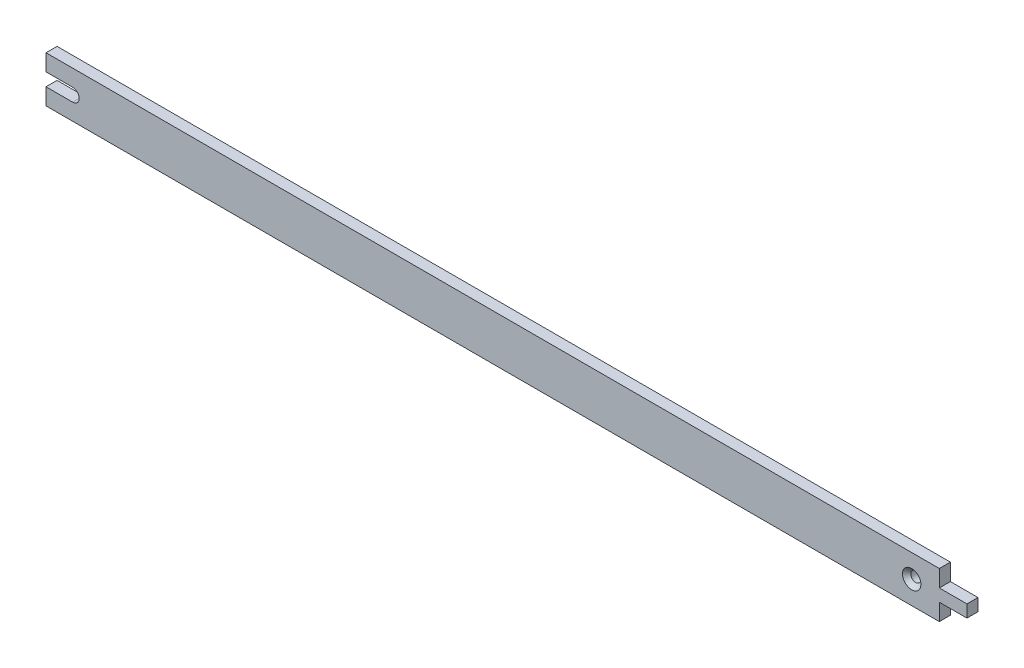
ISO-10303-21;
HEADER;
FILE_DESCRIPTION(('STEP AP214'),'2;1');
FILE_NAME('part.step','',(''),(''),'','','');
FILE_SCHEMA(('AUTOMOTIVE_DESIGN { 1 0 10303 214 1 1 1 1 }'));
ENDSEC;
DATA;
#1=APPLICATION_CONTEXT('core data for automotive mechanical design processes');
#2=APPLICATION_PROTOCOL_DEFINITION('international standard','automotive_design',2000,#1);
#3=PRODUCT_CONTEXT('',#1,'mechanical');
#4=PRODUCT('Part','Part','',(#3));
#5=PRODUCT_RELATED_PRODUCT_CATEGORY('part','',(#4));
#6=PRODUCT_DEFINITION_FORMATION('','',#4);
#7=PRODUCT_DEFINITION_CONTEXT('part definition',#1,'design');
#8=PRODUCT_DEFINITION('design','',#6,#7);
#9=PRODUCT_DEFINITION_SHAPE('','',#8);
#10=(LENGTH_UNIT() NAMED_UNIT(*) SI_UNIT(.MILLI.,.METRE.));
#11=(NAMED_UNIT(*) PLANE_ANGLE_UNIT() SI_UNIT($,.RADIAN.));
#12=(NAMED_UNIT(*) SI_UNIT($,.STERADIAN.) SOLID_ANGLE_UNIT());
#13=UNCERTAINTY_MEASURE_WITH_UNIT(LENGTH_MEASURE(1.E-05),#10,'distance_accuracy_value','');
#14=(GEOMETRIC_REPRESENTATION_CONTEXT(3) GLOBAL_UNCERTAINTY_ASSIGNED_CONTEXT((#13)) GLOBAL_UNIT_ASSIGNED_CONTEXT((#10,
#11,#12)) REPRESENTATION_CONTEXT('',''));
#15=CARTESIAN_POINT('',(0.,0.,0.));
#16=DIRECTION('',(0.,0.,1.));
#17=DIRECTION('',(1.,0.,0.));
#18=AXIS2_PLACEMENT_3D('',#15,#16,#17);
#19=CARTESIAN_POINT('',(15.,12.5,6.));
#20=DIRECTION('',(0.,0.,1.));
#21=DIRECTION('',(0.,1.,0.));
#22=AXIS2_PLACEMENT_3D('',#19,#20,#21);
#23=PLANE('',#22);
#24=DIRECTION('',(0.,1.,0.));
#25=VECTOR('',#24,1.);
#26=CARTESIAN_POINT('',(-470.,-23.4677185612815,6.));
#27=LINE('',#26,#25);
#28=CARTESIAN_POINT('',(-470.,-12.5,6.));
#29=VERTEX_POINT('',#28);
#30=CARTESIAN_POINT('',(-470.,-3.5,6.));
#31=VERTEX_POINT('',#30);
#32=EDGE_CURVE('E105',#29,#31,#27,.T.);
#33=ORIENTED_EDGE('',*,*,#32,.F.);
#34=DIRECTION('',(1.,0.,0.));
#35=VECTOR('',#34,1.);
#36=CARTESIAN_POINT('',(15.,-12.5,6.));
#37=LINE('',#36,#35);
#38=CARTESIAN_POINT('',(15.,-12.5,6.));
#39=VERTEX_POINT('',#38);
#40=EDGE_CURVE('E116',#29,#39,#37,.T.);
#41=ORIENTED_EDGE('',*,*,#40,.T.);
#42=DIRECTION('',(0.,1.,0.));
#43=VECTOR('',#42,1.);
#44=CARTESIAN_POINT('',(15.,-3.35,6.));
#45=LINE('',#44,#43);
#46=CARTESIAN_POINT('',(15.,-3.35,6.));
#47=VERTEX_POINT('',#46);
#48=EDGE_CURVE('E128',#39,#47,#45,.T.);
#49=ORIENTED_EDGE('',*,*,#48,.T.);
#50=DIRECTION('',(1.,0.,0.));
#51=VECTOR('',#50,1.);
#52=CARTESIAN_POINT('',(30.,-3.35,6.));
#53=LINE('',#52,#51);
#54=CARTESIAN_POINT('',(30.,-3.35,6.));
#55=VERTEX_POINT('',#54);
#56=EDGE_CURVE('E131',#47,#55,#53,.T.);
#57=ORIENTED_EDGE('',*,*,#56,.T.);
#58=DIRECTION('',(0.,1.,0.));
#59=VECTOR('',#58,1.);
#60=CARTESIAN_POINT('',(30.,-3.35,6.));
#61=LINE('',#60,#59);
#62=CARTESIAN_POINT('',(30.,3.35,6.));
#63=VERTEX_POINT('',#62);
#64=EDGE_CURVE('E34',#55,#63,#61,.T.);
#65=ORIENTED_EDGE('',*,*,#64,.T.);
#66=DIRECTION('',(-1.,0.,0.));
#67=VECTOR('',#66,1.);
#68=CARTESIAN_POINT('',(30.,3.35,6.));
#69=LINE('',#68,#67);
#70=CARTESIAN_POINT('',(15.,3.35,6.));
#71=VERTEX_POINT('',#70);
#72=EDGE_CURVE('E29',#63,#71,#69,.T.);
#73=ORIENTED_EDGE('',*,*,#72,.T.);
#74=DIRECTION('',(0.,1.,0.));
#75=VECTOR('',#74,1.);
#76=CARTESIAN_POINT('',(15.,3.35,6.));
#77=LINE('',#76,#75);
#78=CARTESIAN_POINT('',(15.,12.5,6.));
#79=VERTEX_POINT('',#78);
#80=EDGE_CURVE('E134',#71,#79,#77,.T.);
#81=ORIENTED_EDGE('',*,*,#80,.T.);
#82=DIRECTION('',(-1.,0.,0.));
#83=VECTOR('',#82,1.);
#84=CARTESIAN_POINT('',(15.,12.5,6.));
#85=LINE('',#84,#83);
#86=CARTESIAN_POINT('',(-470.,12.5,6.));
#87=VERTEX_POINT('',#86);
#88=EDGE_CURVE('E129',#79,#87,#85,.T.);
#89=ORIENTED_EDGE('',*,*,#88,.T.);
#90=CARTESIAN_POINT('',(-470.,3.5,6.));
#91=VERTEX_POINT('',#90);
#92=EDGE_CURVE('E122',#91,#87,#27,.T.);
#93=ORIENTED_EDGE('',*,*,#92,.F.);
#94=DIRECTION('',(-1.,0.,0.));
#95=VECTOR('',#94,1.);
#96=CARTESIAN_POINT('',(-455.5,3.5,6.));
#97=LINE('',#96,#95);
#98=CARTESIAN_POINT('',(-455.5,3.5,6.));
#99=VERTEX_POINT('',#98);
#100=EDGE_CURVE('E267',#99,#91,#97,.T.);
#101=ORIENTED_EDGE('',*,*,#100,.F.);
#102=CARTESIAN_POINT('',(-455.5,0.,6.));
#103=DIRECTION('',(0.,0.,1.));
#104=DIRECTION('',(-1.,0.,0.));
#105=AXIS2_PLACEMENT_3D('',#102,#103,#104);
#106=CIRCLE('',#105,3.5);
#107=CARTESIAN_POINT('',(-455.5,-3.5,6.));
#108=VERTEX_POINT('',#107);
#109=EDGE_CURVE('E264',#108,#99,#106,.T.);
#110=ORIENTED_EDGE('',*,*,#109,.F.);
#111=DIRECTION('',(1.,0.,0.));
#112=VECTOR('',#111,1.);
#113=CARTESIAN_POINT('',(-470.,-3.5,6.));
#114=LINE('',#113,#112);
#115=EDGE_CURVE('E120',#31,#108,#114,.T.);
#116=ORIENTED_EDGE('',*,*,#115,.F.);
#117=EDGE_LOOP('',(#33,#41,#49,#57,#65,#73,#81,#89,#93,#101,#110,#116));
#118=FACE_BOUND('',#117,.T.);
#119=CARTESIAN_POINT('',(0.,0.,6.));
#120=DIRECTION('',(0.,0.,1.));
#121=DIRECTION('',(0.,1.,0.));
#122=AXIS2_PLACEMENT_3D('',#119,#120,#121);
#123=CIRCLE('',#122,5.);
#124=CARTESIAN_POINT('',(0.,5.,6.));
#125=VERTEX_POINT('',#124);
#126=EDGE_CURVE('E9',#125,#125,#123,.F.);
#127=ORIENTED_EDGE('',*,*,#126,.T.);
#128=EDGE_LOOP('',(#127));
#129=FACE_BOUND('',#128,.T.);
#130=ADVANCED_FACE('F14',(#118,#129),#23,.T.);
#131=CARTESIAN_POINT('',(15.,12.5,0.));
#132=DIRECTION('',(0.,0.,1.));
#133=DIRECTION('',(0.,1.,0.));
#134=AXIS2_PLACEMENT_3D('',#131,#132,#133);
#135=PLANE('',#134);
#136=DIRECTION('',(1.,0.,0.));
#137=VECTOR('',#136,1.);
#138=CARTESIAN_POINT('',(15.,-12.5,0.));
#139=LINE('',#138,#137);
#140=CARTESIAN_POINT('',(-470.,-12.5,0.));
#141=VERTEX_POINT('',#140);
#142=CARTESIAN_POINT('',(15.,-12.5,0.));
#143=VERTEX_POINT('',#142);
#144=EDGE_CURVE('E220',#141,#143,#139,.T.);
#145=ORIENTED_EDGE('',*,*,#144,.F.);
#146=DIRECTION('',(0.,1.,0.));
#147=VECTOR('',#146,1.);
#148=CARTESIAN_POINT('',(-470.,-23.4677185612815,0.));
#149=LINE('',#148,#147);
#150=CARTESIAN_POINT('',(-470.,-3.5,0.));
#151=VERTEX_POINT('',#150);
#152=EDGE_CURVE('E108',#141,#151,#149,.T.);
#153=ORIENTED_EDGE('',*,*,#152,.T.);
#154=DIRECTION('',(1.,0.,0.));
#155=VECTOR('',#154,1.);
#156=CARTESIAN_POINT('',(-470.,-3.5,0.));
#157=LINE('',#156,#155);
#158=CARTESIAN_POINT('',(-455.5,-3.5,0.));
#159=VERTEX_POINT('',#158);
#160=EDGE_CURVE('E248',#151,#159,#157,.T.);
#161=ORIENTED_EDGE('',*,*,#160,.T.);
#162=CARTESIAN_POINT('',(-455.5,0.,0.));
#163=DIRECTION('',(0.,0.,1.));
#164=DIRECTION('',(-1.,0.,0.));
#165=AXIS2_PLACEMENT_3D('',#162,#163,#164);
#166=CIRCLE('',#165,3.5);
#167=CARTESIAN_POINT('',(-455.5,3.5,0.));
#168=VERTEX_POINT('',#167);
#169=EDGE_CURVE('E260',#159,#168,#166,.T.);
#170=ORIENTED_EDGE('',*,*,#169,.T.);
#171=DIRECTION('',(-1.,0.,0.));
#172=VECTOR('',#171,1.);
#173=CARTESIAN_POINT('',(-455.5,3.5,0.));
#174=LINE('',#173,#172);
#175=CARTESIAN_POINT('',(-470.,3.5,0.));
#176=VERTEX_POINT('',#175);
#177=EDGE_CURVE('E255',#168,#176,#174,.T.);
#178=ORIENTED_EDGE('',*,*,#177,.T.);
#179=CARTESIAN_POINT('',(-470.,12.5,0.));
#180=VERTEX_POINT('',#179);
#181=EDGE_CURVE('E121',#176,#180,#149,.T.);
#182=ORIENTED_EDGE('',*,*,#181,.T.);
#183=DIRECTION('',(-1.,0.,0.));
#184=VECTOR('',#183,1.);
#185=CARTESIAN_POINT('',(15.,12.5,0.));
#186=LINE('',#185,#184);
#187=CARTESIAN_POINT('',(15.,12.5,0.));
#188=VERTEX_POINT('',#187);
#189=EDGE_CURVE('E215',#188,#180,#186,.T.);
#190=ORIENTED_EDGE('',*,*,#189,.F.);
#191=DIRECTION('',(0.,1.,0.));
#192=VECTOR('',#191,1.);
#193=CARTESIAN_POINT('',(15.,3.35,0.));
#194=LINE('',#193,#192);
#195=CARTESIAN_POINT('',(15.,3.35,0.));
#196=VERTEX_POINT('',#195);
#197=EDGE_CURVE('E221',#196,#188,#194,.T.);
#198=ORIENTED_EDGE('',*,*,#197,.F.);
#199=DIRECTION('',(-1.,0.,0.));
#200=VECTOR('',#199,1.);
#201=CARTESIAN_POINT('',(30.,3.35,0.));
#202=LINE('',#201,#200);
#203=CARTESIAN_POINT('',(30.,3.35,0.));
#204=VERTEX_POINT('',#203);
#205=EDGE_CURVE('E234',#204,#196,#202,.T.);
#206=ORIENTED_EDGE('',*,*,#205,.F.);
#207=DIRECTION('',(0.,1.,0.));
#208=VECTOR('',#207,1.);
#209=CARTESIAN_POINT('',(30.,-3.35,0.));
#210=LINE('',#209,#208);
#211=CARTESIAN_POINT('',(30.,-3.35,0.));
#212=VERTEX_POINT('',#211);
#213=EDGE_CURVE('E232',#212,#204,#210,.T.);
#214=ORIENTED_EDGE('',*,*,#213,.F.);
#215=DIRECTION('',(1.,0.,0.));
#216=VECTOR('',#215,1.);
#217=CARTESIAN_POINT('',(30.,-3.35,0.));
#218=LINE('',#217,#216);
#219=CARTESIAN_POINT('',(15.,-3.35,0.));
#220=VERTEX_POINT('',#219);
#221=EDGE_CURVE('E230',#220,#212,#218,.T.);
#222=ORIENTED_EDGE('',*,*,#221,.F.);
#223=DIRECTION('',(0.,1.,0.));
#224=VECTOR('',#223,1.);
#225=CARTESIAN_POINT('',(15.,-3.35,0.));
#226=LINE('',#225,#224);
#227=EDGE_CURVE('E223',#143,#220,#226,.T.);
#228=ORIENTED_EDGE('',*,*,#227,.F.);
#229=EDGE_LOOP('',(#145,#153,#161,#170,#178,#182,#190,#198,#206,#214,#222,#228));
#230=FACE_BOUND('',#229,.T.);
#231=CARTESIAN_POINT('',(0.,0.,0.));
#232=DIRECTION('',(0.,0.,1.));
#233=DIRECTION('',(0.,1.,0.));
#234=AXIS2_PLACEMENT_3D('',#231,#232,#233);
#235=CIRCLE('',#234,2.75);
#236=CARTESIAN_POINT('',(0.,2.75,0.));
#237=VERTEX_POINT('',#236);
#238=EDGE_CURVE('E225',#237,#237,#235,.T.);
#239=ORIENTED_EDGE('',*,*,#238,.T.);
#240=EDGE_LOOP('',(#239));
#241=FACE_BOUND('',#240,.T.);
#242=ADVANCED_FACE('F180',(#230,#241),#135,.F.);
#243=CARTESIAN_POINT('',(15.,3.35,6.));
#244=DIRECTION('',(-1.,0.,0.));
#245=DIRECTION('',(0.,-1.,0.));
#246=AXIS2_PLACEMENT_3D('',#243,#244,#245);
#247=PLANE('',#246);
#248=ORIENTED_EDGE('',*,*,#197,.T.);
#249=DIRECTION('',(0.,0.,-1.));
#250=VECTOR('',#249,1.);
#251=CARTESIAN_POINT('',(15.,12.5,6.));
#252=LINE('',#251,#250);
#253=EDGE_CURVE('E154',#79,#188,#252,.T.);
#254=ORIENTED_EDGE('',*,*,#253,.F.);
#255=ORIENTED_EDGE('',*,*,#80,.F.);
#256=DIRECTION('',(0.,0.,-1.));
#257=VECTOR('',#256,1.);
#258=CARTESIAN_POINT('',(15.,3.35,6.));
#259=LINE('',#258,#257);
#260=EDGE_CURVE('E141',#71,#196,#259,.T.);
#261=ORIENTED_EDGE('',*,*,#260,.T.);
#262=EDGE_LOOP('',(#248,#254,#255,#261));
#263=FACE_BOUND('',#262,.T.);
#264=ADVANCED_FACE('F16',(#263),#247,.F.);
#265=CARTESIAN_POINT('',(15.,12.5,6.));
#266=DIRECTION('',(0.,-1.,0.));
#267=DIRECTION('',(1.,0.,0.));
#268=AXIS2_PLACEMENT_3D('',#265,#266,#267);
#269=PLANE('',#268);
#270=ORIENTED_EDGE('',*,*,#189,.T.);
#271=DIRECTION('',(0.,0.,1.));
#272=VECTOR('',#271,1.);
#273=CARTESIAN_POINT('',(-470.,12.5,6.));
#274=LINE('',#273,#272);
#275=EDGE_CURVE('E112',#180,#87,#274,.T.);
#276=ORIENTED_EDGE('',*,*,#275,.T.);
#277=ORIENTED_EDGE('',*,*,#88,.F.);
#278=ORIENTED_EDGE('',*,*,#253,.T.);
#279=EDGE_LOOP('',(#270,#276,#277,#278));
#280=FACE_BOUND('',#279,.T.);
#281=ADVANCED_FACE('F205',(#280),#269,.F.);
#282=CARTESIAN_POINT('',(15.,-12.5,6.));
#283=DIRECTION('',(0.,1.,0.));
#284=DIRECTION('',(-1.,0.,0.));
#285=AXIS2_PLACEMENT_3D('',#282,#283,#284);
#286=PLANE('',#285);
#287=ORIENTED_EDGE('',*,*,#40,.F.);
#288=DIRECTION('',(0.,0.,-1.));
#289=VECTOR('',#288,1.);
#290=CARTESIAN_POINT('',(-470.,-12.5,6.));
#291=LINE('',#290,#289);
#292=EDGE_CURVE('E102',#29,#141,#291,.T.);
#293=ORIENTED_EDGE('',*,*,#292,.T.);
#294=ORIENTED_EDGE('',*,*,#144,.T.);
#295=DIRECTION('',(0.,0.,-1.));
#296=VECTOR('',#295,1.);
#297=CARTESIAN_POINT('',(15.,-12.5,6.));
#298=LINE('',#297,#296);
#299=EDGE_CURVE('E126',#39,#143,#298,.T.);
#300=ORIENTED_EDGE('',*,*,#299,.F.);
#301=EDGE_LOOP('',(#287,#293,#294,#300));
#302=FACE_BOUND('',#301,.T.);
#303=ADVANCED_FACE('F124',(#302),#286,.F.);
#304=CARTESIAN_POINT('',(15.,-3.35,6.));
#305=DIRECTION('',(-1.,0.,0.));
#306=DIRECTION('',(0.,-1.,0.));
#307=AXIS2_PLACEMENT_3D('',#304,#305,#306);
#308=PLANE('',#307);
#309=ORIENTED_EDGE('',*,*,#227,.T.);
#310=DIRECTION('',(0.,0.,-1.));
#311=VECTOR('',#310,1.);
#312=CARTESIAN_POINT('',(15.,-3.35,6.));
#313=LINE('',#312,#311);
#314=EDGE_CURVE('E150',#47,#220,#313,.T.);
#315=ORIENTED_EDGE('',*,*,#314,.F.);
#316=ORIENTED_EDGE('',*,*,#48,.F.);
#317=ORIENTED_EDGE('',*,*,#299,.T.);
#318=EDGE_LOOP('',(#309,#315,#316,#317));
#319=FACE_BOUND('',#318,.T.);
#320=ADVANCED_FACE('F199',(#319),#308,.F.);
#321=CARTESIAN_POINT('',(30.,-3.35,6.));
#322=DIRECTION('',(0.,1.,0.));
#323=DIRECTION('',(-1.,0.,0.));
#324=AXIS2_PLACEMENT_3D('',#321,#322,#323);
#325=PLANE('',#324);
#326=ORIENTED_EDGE('',*,*,#221,.T.);
#327=DIRECTION('',(0.,0.,-1.));
#328=VECTOR('',#327,1.);
#329=CARTESIAN_POINT('',(30.,-3.35,6.));
#330=LINE('',#329,#328);
#331=EDGE_CURVE('E147',#55,#212,#330,.T.);
#332=ORIENTED_EDGE('',*,*,#331,.F.);
#333=ORIENTED_EDGE('',*,*,#56,.F.);
#334=ORIENTED_EDGE('',*,*,#314,.T.);
#335=EDGE_LOOP('',(#326,#332,#333,#334));
#336=FACE_BOUND('',#335,.T.);
#337=ADVANCED_FACE('F195',(#336),#325,.F.);
#338=CARTESIAN_POINT('',(30.,-3.35,6.));
#339=DIRECTION('',(-1.,0.,0.));
#340=DIRECTION('',(0.,-1.,0.));
#341=AXIS2_PLACEMENT_3D('',#338,#339,#340);
#342=PLANE('',#341);
#343=ORIENTED_EDGE('',*,*,#213,.T.);
#344=DIRECTION('',(0.,0.,-1.));
#345=VECTOR('',#344,1.);
#346=CARTESIAN_POINT('',(30.,3.35,6.));
#347=LINE('',#346,#345);
#348=EDGE_CURVE('E144',#63,#204,#347,.T.);
#349=ORIENTED_EDGE('',*,*,#348,.F.);
#350=ORIENTED_EDGE('',*,*,#64,.F.);
#351=ORIENTED_EDGE('',*,*,#331,.T.);
#352=EDGE_LOOP('',(#343,#349,#350,#351));
#353=FACE_BOUND('',#352,.T.);
#354=ADVANCED_FACE('F191',(#353),#342,.F.);
#355=CARTESIAN_POINT('',(30.,3.35,6.));
#356=DIRECTION('',(0.,-1.,0.));
#357=DIRECTION('',(1.,0.,0.));
#358=AXIS2_PLACEMENT_3D('',#355,#356,#357);
#359=PLANE('',#358);
#360=ORIENTED_EDGE('',*,*,#205,.T.);
#361=ORIENTED_EDGE('',*,*,#260,.F.);
#362=ORIENTED_EDGE('',*,*,#72,.F.);
#363=ORIENTED_EDGE('',*,*,#348,.T.);
#364=EDGE_LOOP('',(#360,#361,#362,#363));
#365=FACE_BOUND('',#364,.T.);
#366=ADVANCED_FACE('F176',(#365),#359,.F.);
#367=CARTESIAN_POINT('',(0.,0.,6.));
#368=DIRECTION('',(0.,0.,-1.));
#369=DIRECTION('',(0.,-1.,0.));
#370=AXIS2_PLACEMENT_3D('',#367,#368,#369);
#371=CYLINDRICAL_SURFACE('',#370,2.75);
#372=CARTESIAN_POINT('',(0.,0.,3.75));
#373=DIRECTION('',(0.,0.,1.));
#374=DIRECTION('',(0.,1.,0.));
#375=AXIS2_PLACEMENT_3D('',#372,#373,#374);
#376=CIRCLE('',#375,2.75);
#377=CARTESIAN_POINT('',(0.,2.75,3.75));
#378=VERTEX_POINT('',#377);
#379=EDGE_CURVE('E22',#378,#378,#376,.T.);
#380=ORIENTED_EDGE('',*,*,#379,.T.);
#381=EDGE_LOOP('',(#380));
#382=FACE_BOUND('',#381,.T.);
#383=ORIENTED_EDGE('',*,*,#238,.F.);
#384=EDGE_LOOP('',(#383));
#385=FACE_BOUND('',#384,.T.);
#386=ADVANCED_FACE('F159',(#382,#385),#371,.F.);
#387=CARTESIAN_POINT('',(0.,0.,3.75));
#388=DIRECTION('',(0.,0.,1.));
#389=DIRECTION('',(0.,1.,0.));
#390=AXIS2_PLACEMENT_3D('',#387,#388,#389);
#391=CONICAL_SURFACE('',#390,2.75,0.78539816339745);
#392=ORIENTED_EDGE('',*,*,#126,.F.);
#393=EDGE_LOOP('',(#392));
#394=FACE_BOUND('',#393,.T.);
#395=ORIENTED_EDGE('',*,*,#379,.F.);
#396=EDGE_LOOP('',(#395));
#397=FACE_BOUND('',#396,.T.);
#398=ADVANCED_FACE('F162',(#394,#397),#391,.F.);
#399=CARTESIAN_POINT('',(-455.5,0.,0.));
#400=DIRECTION('',(0.,0.,1.));
#401=DIRECTION('',(-1.,0.,0.));
#402=AXIS2_PLACEMENT_3D('',#399,#400,#401);
#403=CYLINDRICAL_SURFACE('',#402,3.5);
#404=ORIENTED_EDGE('',*,*,#109,.T.);
#405=DIRECTION('',(0.,0.,1.));
#406=VECTOR('',#405,1.);
#407=CARTESIAN_POINT('',(-455.5,3.5,0.));
#408=LINE('',#407,#406);
#409=EDGE_CURVE('E254',#168,#99,#408,.T.);
#410=ORIENTED_EDGE('',*,*,#409,.F.);
#411=ORIENTED_EDGE('',*,*,#169,.F.);
#412=DIRECTION('',(0.,0.,1.));
#413=VECTOR('',#412,1.);
#414=CARTESIAN_POINT('',(-455.5,-3.5,0.));
#415=LINE('',#414,#413);
#416=EDGE_CURVE('E252',#159,#108,#415,.T.);
#417=ORIENTED_EDGE('',*,*,#416,.T.);
#418=EDGE_LOOP('',(#404,#410,#411,#417));
#419=FACE_BOUND('',#418,.T.);
#420=ADVANCED_FACE('F164',(#419),#403,.F.);
#421=CARTESIAN_POINT('',(-470.,-3.5,0.));
#422=DIRECTION('',(0.,-1.,0.));
#423=DIRECTION('',(0.,0.,1.));
#424=AXIS2_PLACEMENT_3D('',#421,#422,#423);
#425=PLANE('',#424);
#426=ORIENTED_EDGE('',*,*,#115,.T.);
#427=ORIENTED_EDGE('',*,*,#416,.F.);
#428=ORIENTED_EDGE('',*,*,#160,.F.);
#429=DIRECTION('',(0.,0.,1.));
#430=VECTOR('',#429,1.);
#431=CARTESIAN_POINT('',(-470.,-3.5,0.));
#432=LINE('',#431,#430);
#433=EDGE_CURVE('E251',#151,#31,#432,.T.);
#434=ORIENTED_EDGE('',*,*,#433,.T.);
#435=EDGE_LOOP('',(#426,#427,#428,#434));
#436=FACE_BOUND('',#435,.T.);
#437=ADVANCED_FACE('F173',(#436),#425,.F.);
#438=CARTESIAN_POINT('',(-455.5,3.5,0.));
#439=DIRECTION('',(0.,1.,0.));
#440=DIRECTION('',(0.,0.,-1.));
#441=AXIS2_PLACEMENT_3D('',#438,#439,#440);
#442=PLANE('',#441);
#443=ORIENTED_EDGE('',*,*,#100,.T.);
#444=DIRECTION('',(0.,0.,1.));
#445=VECTOR('',#444,1.);
#446=CARTESIAN_POINT('',(-470.,3.5,0.));
#447=LINE('',#446,#445);
#448=EDGE_CURVE('E257',#176,#91,#447,.T.);
#449=ORIENTED_EDGE('',*,*,#448,.F.);
#450=ORIENTED_EDGE('',*,*,#177,.F.);
#451=ORIENTED_EDGE('',*,*,#409,.T.);
#452=EDGE_LOOP('',(#443,#449,#450,#451));
#453=FACE_BOUND('',#452,.T.);
#454=ADVANCED_FACE('F281',(#453),#442,.F.);
#455=CARTESIAN_POINT('',(-470.,-23.4677185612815,0.));
#456=DIRECTION('',(1.,0.,0.));
#457=DIRECTION('',(0.,0.,1.));
#458=AXIS2_PLACEMENT_3D('',#455,#456,#457);
#459=PLANE('',#458);
#460=ORIENTED_EDGE('',*,*,#181,.F.);
#461=ORIENTED_EDGE('',*,*,#448,.T.);
#462=ORIENTED_EDGE('',*,*,#92,.T.);
#463=ORIENTED_EDGE('',*,*,#275,.F.);
#464=EDGE_LOOP('',(#460,#461,#462,#463));
#465=FACE_BOUND('',#464,.T.);
#466=ADVANCED_FACE('F277',(#465),#459,.F.);
#467=ORIENTED_EDGE('',*,*,#32,.T.);
#468=ORIENTED_EDGE('',*,*,#433,.F.);
#469=ORIENTED_EDGE('',*,*,#152,.F.);
#470=ORIENTED_EDGE('',*,*,#292,.F.);
#471=EDGE_LOOP('',(#467,#468,#469,#470));
#472=FACE_BOUND('',#471,.T.);
#473=ADVANCED_FACE('F104',(#472),#459,.F.);
#474=CLOSED_SHELL('',(#130,#242,#264,#281,#303,#320,#337,#354,#366,#386,#398,#420,#437,#454,
#466,#473));
#475=MANIFOLD_SOLID_BREP('B1',#474);
#476=ADVANCED_BREP_SHAPE_REPRESENTATION('',(#18,#475),#14);
#477=SHAPE_DEFINITION_REPRESENTATION(#9,#476);
ENDSEC;
END-ISO-10303-21;
